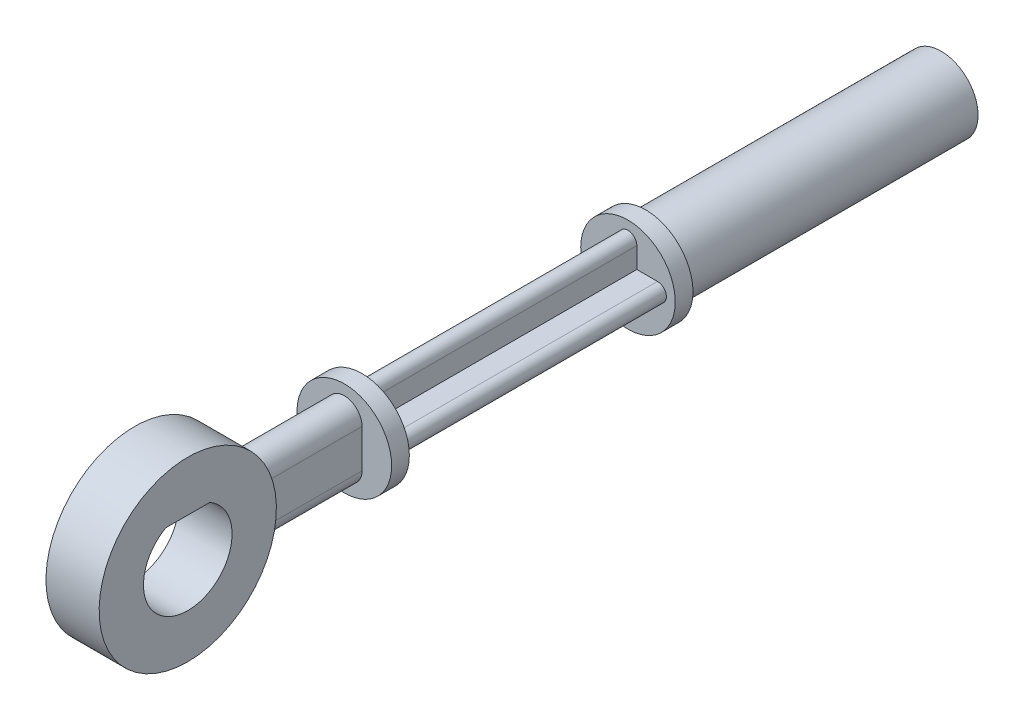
ISO-10303-21;
HEADER;
FILE_DESCRIPTION(('STEP AP214'),'2;1');
FILE_NAME('part.step','',(''),(''),'','','');
FILE_SCHEMA(('AUTOMOTIVE_DESIGN { 1 0 10303 214 1 1 1 1 }'));
ENDSEC;
DATA;
#1=APPLICATION_CONTEXT('core data for automotive mechanical design processes');
#2=APPLICATION_PROTOCOL_DEFINITION('international standard','automotive_design',2000,#1);
#3=PRODUCT_CONTEXT('',#1,'mechanical');
#4=PRODUCT('Part','Part','',(#3));
#5=PRODUCT_RELATED_PRODUCT_CATEGORY('part','',(#4));
#6=PRODUCT_DEFINITION_FORMATION('','',#4);
#7=PRODUCT_DEFINITION_CONTEXT('part definition',#1,'design');
#8=PRODUCT_DEFINITION('design','',#6,#7);
#9=PRODUCT_DEFINITION_SHAPE('','',#8);
#10=(LENGTH_UNIT() NAMED_UNIT(*) SI_UNIT(.MILLI.,.METRE.));
#11=(NAMED_UNIT(*) PLANE_ANGLE_UNIT() SI_UNIT($,.RADIAN.));
#12=(NAMED_UNIT(*) SI_UNIT($,.STERADIAN.) SOLID_ANGLE_UNIT());
#13=UNCERTAINTY_MEASURE_WITH_UNIT(LENGTH_MEASURE(1.E-05),#10,'distance_accuracy_value','');
#14=(GEOMETRIC_REPRESENTATION_CONTEXT(3) GLOBAL_UNCERTAINTY_ASSIGNED_CONTEXT((#13)) GLOBAL_UNIT_ASSIGNED_CONTEXT((#10,
#11,#12)) REPRESENTATION_CONTEXT('',''));
#15=CARTESIAN_POINT('',(0.,0.,0.));
#16=DIRECTION('',(0.,0.,1.));
#17=DIRECTION('',(1.,0.,0.));
#18=AXIS2_PLACEMENT_3D('',#15,#16,#17);
#19=CARTESIAN_POINT('',(0.,0.,-99.));
#20=DIRECTION('',(0.,0.,-1.));
#21=DIRECTION('',(-1.,0.,0.));
#22=AXIS2_PLACEMENT_3D('',#19,#20,#21);
#23=PLANE('',#22);
#24=CARTESIAN_POINT('',(0.,0.,-99.));
#25=DIRECTION('',(0.,0.,-1.));
#26=DIRECTION('',(-1.,0.,0.));
#27=AXIS2_PLACEMENT_3D('',#24,#25,#26);
#28=CIRCLE('',#27,16.);
#29=CARTESIAN_POINT('',(-16.,0.,-99.));
#30=VERTEX_POINT('',#29);
#31=EDGE_CURVE('E220',#30,#30,#28,.T.);
#32=ORIENTED_EDGE('',*,*,#31,.T.);
#33=EDGE_LOOP('',(#32));
#34=FACE_BOUND('',#33,.T.);
#35=CARTESIAN_POINT('',(0.,0.,-99.));
#36=DIRECTION('',(0.,0.,-1.));
#37=DIRECTION('',(-1.,0.,0.));
#38=AXIS2_PLACEMENT_3D('',#35,#36,#37);
#39=CIRCLE('',#38,12.5);
#40=CARTESIAN_POINT('',(-12.5,0.,-99.));
#41=VERTEX_POINT('',#40);
#42=EDGE_CURVE('E174',#41,#41,#39,.T.);
#43=ORIENTED_EDGE('',*,*,#42,.F.);
#44=EDGE_LOOP('',(#43));
#45=FACE_BOUND('',#44,.T.);
#46=ADVANCED_FACE('F34',(#34,#45),#23,.T.);
#47=CARTESIAN_POINT('',(0.,6.5,92.7308492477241));
#48=DIRECTION('',(0.,0.,-1.));
#49=DIRECTION('',(-1.,0.,0.));
#50=AXIS2_PLACEMENT_3D('',#47,#48,#49);
#51=CYLINDRICAL_SURFACE('',#50,6.);
#52=CARTESIAN_POINT('',(6.,6.5,35.7126307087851));
#53=CARTESIAN_POINT('',(6.00001683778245,6.67468075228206,35.7513827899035));
#54=CARTESIAN_POINT('',(5.99237280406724,6.8489880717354,35.7917237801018));
#55=CARTESIAN_POINT('',(5.96207767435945,7.19557585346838,35.8751790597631));
#56=CARTESIAN_POINT('',(5.93943067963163,7.36785685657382,35.9182925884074));
#57=CARTESIAN_POINT('',(5.87949365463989,7.70892613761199,36.0068366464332));
#58=CARTESIAN_POINT('',(5.84222793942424,7.87771972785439,36.0522632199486));
#59=CARTESIAN_POINT('',(5.75345581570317,8.21098845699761,36.1450251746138));
#60=CARTESIAN_POINT('',(5.70194864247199,8.37546336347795,36.1923606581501));
#61=CARTESIAN_POINT('',(5.58519716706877,8.69888805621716,36.2883684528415));
#62=CARTESIAN_POINT('',(5.51996442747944,8.85784236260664,36.3370396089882));
#63=CARTESIAN_POINT('',(5.37620421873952,9.1694341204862,36.4351935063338));
#64=CARTESIAN_POINT('',(5.29767188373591,9.32206923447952,36.4846765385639));
#65=CARTESIAN_POINT('',(5.12785042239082,9.6200250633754,36.5838114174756));
#66=CARTESIAN_POINT('',(5.03656053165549,9.76534533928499,36.6334632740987));
#67=CARTESIAN_POINT('',(4.84175083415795,10.0478011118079,36.7322782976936));
#68=CARTESIAN_POINT('',(4.73822677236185,10.1849337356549,36.781441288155));
#69=CARTESIAN_POINT('',(4.51716721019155,10.4529780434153,36.8796147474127));
#70=CARTESIAN_POINT('',(4.39937446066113,10.5836876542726,36.9285982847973));
#71=CARTESIAN_POINT('',(4.15234530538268,10.8346310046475,37.0244961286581));
#72=CARTESIAN_POINT('',(4.02310928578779,10.95486509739,37.0714105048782));
#73=CARTESIAN_POINT('',(3.75391275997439,11.1839492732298,37.1623551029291));
#74=CARTESIAN_POINT('',(3.61395004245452,11.2927969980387,37.2063847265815));
#75=CARTESIAN_POINT('',(3.3242357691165,11.4980955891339,37.2906854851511));
#76=CARTESIAN_POINT('',(3.17448871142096,11.5945520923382,37.3309583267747));
#77=CARTESIAN_POINT('',(2.87078464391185,11.7714837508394,37.4057774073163));
#78=CARTESIAN_POINT('',(2.71709124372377,11.8523534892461,37.4404598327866));
#79=CARTESIAN_POINT('',(2.40246071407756,12.0007653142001,37.5047608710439));
#80=CARTESIAN_POINT('',(2.24152699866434,12.0683136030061,37.5343818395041));
#81=CARTESIAN_POINT('',(1.91359644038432,12.1893481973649,37.587882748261));
#82=CARTESIAN_POINT('',(1.74660196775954,12.2428399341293,37.6117649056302));
#83=CARTESIAN_POINT('',(1.40783822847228,12.3351351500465,37.6532084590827));
#84=CARTESIAN_POINT('',(1.23606938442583,12.3739399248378,37.6707704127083));
#85=CARTESIAN_POINT('',(0.903621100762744,12.4337667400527,37.6979409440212));
#86=CARTESIAN_POINT('',(0.743201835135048,12.4559956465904,37.7080878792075));
#87=CARTESIAN_POINT('',(0.420830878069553,12.4874137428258,37.7224487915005));
#88=CARTESIAN_POINT('',(0.258879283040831,12.496603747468,37.7266631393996));
#89=CARTESIAN_POINT('',(-0.0652387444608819,12.5018337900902,37.7290601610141));
#90=CARTESIAN_POINT('',(-0.227405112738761,12.4978771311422,37.7272443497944));
#91=CARTESIAN_POINT('',(-0.550706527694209,12.4768688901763,37.7176270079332));
#92=CARTESIAN_POINT('',(-0.71184159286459,12.459817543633,37.7098255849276));
#93=CARTESIAN_POINT('',(-1.02365872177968,12.4140237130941,37.6889654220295));
#94=CARTESIAN_POINT('',(-1.17445482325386,12.3859217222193,37.6761950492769));
#95=CARTESIAN_POINT('',(-1.47302447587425,12.3183874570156,37.6456821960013));
#96=CARTESIAN_POINT('',(-1.62079702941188,12.2789515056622,37.627938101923));
#97=CARTESIAN_POINT('',(-1.91228800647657,12.1891481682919,37.5878296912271));
#98=CARTESIAN_POINT('',(-2.05600752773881,12.138783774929,37.5654666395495));
#99=CARTESIAN_POINT('',(-2.33863654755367,12.0275541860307,37.5165207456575));
#100=CARTESIAN_POINT('',(-2.47754419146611,11.9666849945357,37.489936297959));
#101=CARTESIAN_POINT('',(-2.7543570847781,11.8327240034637,37.4320450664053));
#102=CARTESIAN_POINT('',(-2.89206887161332,11.7592879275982,37.4006087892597));
#103=CARTESIAN_POINT('',(-3.16076574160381,11.6023332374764,37.3342606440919));
#104=CARTESIAN_POINT('',(-3.29174833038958,11.5188109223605,37.2993475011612));
#105=CARTESIAN_POINT('',(-3.67354374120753,11.2540353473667,37.1902345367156));
#106=CARTESIAN_POINT('',(-3.91339510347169,11.0584804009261,37.111620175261));
#107=CARTESIAN_POINT('',(-4.37696518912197,10.617380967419,36.9405705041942));
#108=CARTESIAN_POINT('',(-4.59781140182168,10.3690729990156,36.8475316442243));
#109=CARTESIAN_POINT('',(-4.99540001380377,9.8399695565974,36.6582686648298));
#110=CARTESIAN_POINT('',(-5.17211297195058,9.55915257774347,36.5620424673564));
#111=CARTESIAN_POINT('',(-5.40510638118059,9.11064256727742,36.4163864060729));
#112=CARTESIAN_POINT('',(-5.47889311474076,8.95201500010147,36.3662769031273));
#113=CARTESIAN_POINT('',(-5.61243633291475,8.62864118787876,36.2671777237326));
#114=CARTESIAN_POINT('',(-5.6721977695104,8.46389712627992,36.2181876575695));
#115=CARTESIAN_POINT('',(-5.77712565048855,8.12956823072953,36.1219744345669));
#116=CARTESIAN_POINT('',(-5.82230945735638,7.95998941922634,36.0747492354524));
#117=CARTESIAN_POINT('',(-5.8977186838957,7.61701279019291,35.9825462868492));
#118=CARTESIAN_POINT('',(-5.92795163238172,7.44361694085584,35.9375674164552));
#119=CARTESIAN_POINT('',(-5.96696182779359,7.14173021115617,35.8621744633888));
#120=CARTESIAN_POINT('',(-5.97933805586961,7.01385157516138,35.8311260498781));
#121=CARTESIAN_POINT('',(-5.99585278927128,6.75738395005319,35.7706456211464));
#122=CARTESIAN_POINT('',(-6.00000340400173,6.62879628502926,35.7412112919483));
#123=CARTESIAN_POINT('',(-6.,6.5,35.7126307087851));
#124=B_SPLINE_CURVE_WITH_KNOTS('',3,(#52,#53,#54,#55,#56,#57,#58,#59,#60,#61,#62,#63,#64,#65,
#66,#67,#68,#69,#70,#71,#72,#73,#74,#75,#76,#77,#78,#79,#80,#81,#82,#83,#84,#85,#86,#87,#88,#89,
#90,#91,#92,#93,#94,#95,#96,#97,#98,#99,#100,#101,#102,#103,#104,#105,#106,#107,#108,#109,#110,
#111,#112,#113,#114,#115,#116,#117,#118,#119,#120,#121,#122,#123),.UNSPECIFIED.,.F.,.F.,(4,2,2,
2,2,2,2,2,2,2,2,2,2,2,2,2,2,2,2,2,2,2,2,2,2,2,2,2,2,2,2,2,2,2,2,4),(0.,0.536582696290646,
1.07301877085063,1.60856635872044,2.14414270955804,2.67926967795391,3.21459285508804,
3.74994812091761,4.28549013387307,4.83276333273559,5.38001807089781,5.92738593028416,
6.47450389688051,7.00510328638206,7.53545505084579,8.06560159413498,8.59570135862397,
9.08188575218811,9.56803975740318,10.0540716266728,10.540094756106,11.0013345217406,
11.4627240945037,11.923987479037,12.3854267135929,12.8625019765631,13.3397528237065,
14.2936127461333,15.3245982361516,16.3562696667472,16.9016825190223,17.4469025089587,
17.9914707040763,18.5357643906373,18.9320335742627,19.3277189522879),.UNSPECIFIED.);
#125=CARTESIAN_POINT('',(6.,6.5,35.7126307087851));
#126=VERTEX_POINT('',#125);
#127=CARTESIAN_POINT('',(-6.,6.5,35.7126307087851));
#128=VERTEX_POINT('',#127);
#129=EDGE_CURVE('E212',#126,#128,#124,.T.);
#130=ORIENTED_EDGE('',*,*,#129,.F.);
#131=DIRECTION('',(0.,0.,-1.));
#132=VECTOR('',#131,1.);
#133=CARTESIAN_POINT('',(6.,6.5,92.7308492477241));
#134=LINE('',#133,#132);
#135=CARTESIAN_POINT('',(6.,6.5,3.));
#136=VERTEX_POINT('',#135);
#137=EDGE_CURVE('E312',#126,#136,#134,.T.);
#138=ORIENTED_EDGE('',*,*,#137,.T.);
#139=CARTESIAN_POINT('',(0.,6.5,3.));
#140=DIRECTION('',(0.,0.,1.));
#141=DIRECTION('',(1.,0.,0.));
#142=AXIS2_PLACEMENT_3D('',#139,#140,#141);
#143=CIRCLE('',#142,6.);
#144=CARTESIAN_POINT('',(-6.,6.5,3.));
#145=VERTEX_POINT('',#144);
#146=EDGE_CURVE('E328',#136,#145,#143,.T.);
#147=ORIENTED_EDGE('',*,*,#146,.T.);
#148=DIRECTION('',(0.,0.,-1.));
#149=VECTOR('',#148,1.);
#150=CARTESIAN_POINT('',(-6.,6.5,92.7308492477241));
#151=LINE('',#150,#149);
#152=EDGE_CURVE('E324',#128,#145,#151,.T.);
#153=ORIENTED_EDGE('',*,*,#152,.F.);
#154=EDGE_LOOP('',(#130,#138,#147,#153));
#155=FACE_BOUND('',#154,.T.);
#156=ADVANCED_FACE('F222',(#155),#51,.T.);
#157=CARTESIAN_POINT('',(0.,-6.5,92.7308492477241));
#158=DIRECTION('',(0.,0.,-1.));
#159=DIRECTION('',(-1.,0.,0.));
#160=AXIS2_PLACEMENT_3D('',#157,#158,#159);
#161=CYLINDRICAL_SURFACE('',#160,6.);
#162=CARTESIAN_POINT('',(-6.,-6.5,35.7126307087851));
#163=CARTESIAN_POINT('',(-6.00001683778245,-6.67468075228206,35.7513827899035));
#164=CARTESIAN_POINT('',(-5.99237280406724,-6.8489880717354,35.7917237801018));
#165=CARTESIAN_POINT('',(-5.96207767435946,-7.19557585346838,35.8751790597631));
#166=CARTESIAN_POINT('',(-5.93943067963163,-7.36785685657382,35.9182925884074));
#167=CARTESIAN_POINT('',(-5.8794936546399,-7.70892613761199,36.0068366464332));
#168=CARTESIAN_POINT('',(-5.84222793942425,-7.87771972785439,36.0522632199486));
#169=CARTESIAN_POINT('',(-5.75345581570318,-8.21098845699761,36.1450251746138));
#170=CARTESIAN_POINT('',(-5.70194864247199,-8.37546336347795,36.1923606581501));
#171=CARTESIAN_POINT('',(-5.58519716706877,-8.69888805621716,36.2883684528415));
#172=CARTESIAN_POINT('',(-5.51996442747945,-8.85784236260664,36.3370396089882));
#173=CARTESIAN_POINT('',(-5.37620421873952,-9.1694341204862,36.4351935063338));
#174=CARTESIAN_POINT('',(-5.29767188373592,-9.32206923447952,36.4846765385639));
#175=CARTESIAN_POINT('',(-5.12785042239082,-9.6200250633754,36.5838114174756));
#176=CARTESIAN_POINT('',(-5.0365605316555,-9.76534533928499,36.6334632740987));
#177=CARTESIAN_POINT('',(-4.84175083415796,-10.0478011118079,36.7322782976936));
#178=CARTESIAN_POINT('',(-4.73822677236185,-10.1849337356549,36.781441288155));
#179=CARTESIAN_POINT('',(-4.51716721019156,-10.4529780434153,36.8796147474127));
#180=CARTESIAN_POINT('',(-4.39937446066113,-10.5836876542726,36.9285982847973));
#181=CARTESIAN_POINT('',(-4.15234530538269,-10.8346310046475,37.0244961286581));
#182=CARTESIAN_POINT('',(-4.0231092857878,-10.95486509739,37.0714105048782));
#183=CARTESIAN_POINT('',(-3.75391275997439,-11.1839492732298,37.1623551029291));
#184=CARTESIAN_POINT('',(-3.61395004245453,-11.2927969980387,37.2063847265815));
#185=CARTESIAN_POINT('',(-3.32423576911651,-11.4980955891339,37.2906854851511));
#186=CARTESIAN_POINT('',(-3.17448871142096,-11.5945520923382,37.3309583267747));
#187=CARTESIAN_POINT('',(-2.87078464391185,-11.7714837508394,37.4057774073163));
#188=CARTESIAN_POINT('',(-2.71709124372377,-11.8523534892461,37.4404598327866));
#189=CARTESIAN_POINT('',(-2.40246071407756,-12.0007653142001,37.5047608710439));
#190=CARTESIAN_POINT('',(-2.24152699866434,-12.0683136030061,37.5343818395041));
#191=CARTESIAN_POINT('',(-1.91359644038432,-12.1893481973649,37.587882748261));
#192=CARTESIAN_POINT('',(-1.74660196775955,-12.2428399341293,37.6117649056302));
#193=CARTESIAN_POINT('',(-1.40783822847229,-12.3351351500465,37.6532084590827));
#194=CARTESIAN_POINT('',(-1.23606938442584,-12.3739399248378,37.6707704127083));
#195=CARTESIAN_POINT('',(-0.903621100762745,-12.4337667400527,37.6979409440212));
#196=CARTESIAN_POINT('',(-0.743201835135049,-12.4559956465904,37.7080878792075));
#197=CARTESIAN_POINT('',(-0.420830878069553,-12.4874137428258,37.7224487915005));
#198=CARTESIAN_POINT('',(-0.258879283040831,-12.496603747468,37.7266631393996));
#199=CARTESIAN_POINT('',(0.0652387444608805,-12.5018337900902,37.7290601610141));
#200=CARTESIAN_POINT('',(0.227405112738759,-12.4978771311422,37.7272443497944));
#201=CARTESIAN_POINT('',(0.550706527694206,-12.4768688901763,37.7176270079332));
#202=CARTESIAN_POINT('',(0.711841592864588,-12.459817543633,37.7098255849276));
#203=CARTESIAN_POINT('',(1.02365872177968,-12.4140237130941,37.6889654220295));
#204=CARTESIAN_POINT('',(1.17445482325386,-12.3859217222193,37.6761950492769));
#205=CARTESIAN_POINT('',(1.47302447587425,-12.3183874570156,37.6456821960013));
#206=CARTESIAN_POINT('',(1.62079702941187,-12.2789515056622,37.627938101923));
#207=CARTESIAN_POINT('',(1.91228800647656,-12.1891481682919,37.5878296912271));
#208=CARTESIAN_POINT('',(2.05600752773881,-12.138783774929,37.5654666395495));
#209=CARTESIAN_POINT('',(2.33863654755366,-12.0275541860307,37.5165207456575));
#210=CARTESIAN_POINT('',(2.4775441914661,-11.9666849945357,37.489936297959));
#211=CARTESIAN_POINT('',(2.7543570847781,-11.8327240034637,37.4320450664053));
#212=CARTESIAN_POINT('',(2.89206887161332,-11.7592879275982,37.4006087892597));
#213=CARTESIAN_POINT('',(3.16076574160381,-11.6023332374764,37.3342606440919));
#214=CARTESIAN_POINT('',(3.29174833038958,-11.5188109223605,37.2993475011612));
#215=CARTESIAN_POINT('',(3.67354374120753,-11.2540353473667,37.1902345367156));
#216=CARTESIAN_POINT('',(3.91339510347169,-11.0584804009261,37.111620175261));
#217=CARTESIAN_POINT('',(4.37696518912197,-10.617380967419,36.9405705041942));
#218=CARTESIAN_POINT('',(4.59781140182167,-10.3690729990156,36.8475316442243));
#219=CARTESIAN_POINT('',(4.99540001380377,-9.8399695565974,36.6582686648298));
#220=CARTESIAN_POINT('',(5.17211297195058,-9.55915257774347,36.5620424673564));
#221=CARTESIAN_POINT('',(5.40510638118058,-9.11064256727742,36.4163864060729));
#222=CARTESIAN_POINT('',(5.47889311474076,-8.95201500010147,36.3662769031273));
#223=CARTESIAN_POINT('',(5.61243633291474,-8.62864118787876,36.2671777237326));
#224=CARTESIAN_POINT('',(5.6721977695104,-8.46389712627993,36.2181876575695));
#225=CARTESIAN_POINT('',(5.77712565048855,-8.12956823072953,36.1219744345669));
#226=CARTESIAN_POINT('',(5.82230945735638,-7.95998941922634,36.0747492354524));
#227=CARTESIAN_POINT('',(5.89771868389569,-7.61701279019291,35.9825462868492));
#228=CARTESIAN_POINT('',(5.92795163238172,-7.44361694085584,35.9375674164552));
#229=CARTESIAN_POINT('',(5.96696182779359,-7.14173021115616,35.8621744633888));
#230=CARTESIAN_POINT('',(5.97933805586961,-7.01385157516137,35.8311260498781));
#231=CARTESIAN_POINT('',(5.99585278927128,-6.75738395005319,35.7706456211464));
#232=CARTESIAN_POINT('',(6.00000340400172,-6.62879628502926,35.7412112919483));
#233=CARTESIAN_POINT('',(6.,-6.5,35.7126307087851));
#234=B_SPLINE_CURVE_WITH_KNOTS('',3,(#162,#163,#164,#165,#166,#167,#168,#169,#170,#171,#172,
#173,#174,#175,#176,#177,#178,#179,#180,#181,#182,#183,#184,#185,#186,#187,#188,#189,#190,#191,
#192,#193,#194,#195,#196,#197,#198,#199,#200,#201,#202,#203,#204,#205,#206,#207,#208,#209,#210,
#211,#212,#213,#214,#215,#216,#217,#218,#219,#220,#221,#222,#223,#224,#225,#226,#227,#228,#229,
#230,#231,#232,#233),.UNSPECIFIED.,.F.,.F.,(4,2,2,2,2,2,2,2,2,2,2,2,2,2,2,2,2,2,2,2,2,2,2,2,2,2,
2,2,2,2,2,2,2,2,2,4),(0.,0.536582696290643,1.07301877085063,1.60856635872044,2.14414270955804,
2.67926967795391,3.21459285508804,3.74994812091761,4.28549013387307,4.83276333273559,
5.38001807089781,5.92738593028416,6.47450389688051,7.00510328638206,7.53545505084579,
8.06560159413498,8.59570135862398,9.08188575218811,9.56803975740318,10.0540716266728,
10.540094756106,11.0013345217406,11.4627240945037,11.923987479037,12.3854267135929,
12.8625019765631,13.3397528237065,14.2936127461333,15.3245982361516,16.3562696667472,
16.9016825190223,17.4469025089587,17.9914707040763,18.5357643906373,18.9320335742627,
19.3277189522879),.UNSPECIFIED.);
#235=CARTESIAN_POINT('',(-6.,-6.5,35.7126307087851));
#236=VERTEX_POINT('',#235);
#237=CARTESIAN_POINT('',(6.,-6.5,35.7126307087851));
#238=VERTEX_POINT('',#237);
#239=EDGE_CURVE('E187',#236,#238,#234,.T.);
#240=ORIENTED_EDGE('',*,*,#239,.F.);
#241=DIRECTION('',(0.,0.,-1.));
#242=VECTOR('',#241,1.);
#243=CARTESIAN_POINT('',(-6.,-6.5,92.7308492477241));
#244=LINE('',#243,#242);
#245=CARTESIAN_POINT('',(-6.,-6.5,3.));
#246=VERTEX_POINT('',#245);
#247=EDGE_CURVE('E326',#236,#246,#244,.T.);
#248=ORIENTED_EDGE('',*,*,#247,.T.);
#249=CARTESIAN_POINT('',(0.,-6.5,3.));
#250=DIRECTION('',(0.,0.,1.));
#251=DIRECTION('',(1.,0.,0.));
#252=AXIS2_PLACEMENT_3D('',#249,#250,#251);
#253=CIRCLE('',#252,6.);
#254=CARTESIAN_POINT('',(6.,-6.5,3.));
#255=VERTEX_POINT('',#254);
#256=EDGE_CURVE('E317',#246,#255,#253,.T.);
#257=ORIENTED_EDGE('',*,*,#256,.T.);
#258=DIRECTION('',(0.,0.,-1.));
#259=VECTOR('',#258,1.);
#260=CARTESIAN_POINT('',(6.,-6.5,92.7308492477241));
#261=LINE('',#260,#259);
#262=EDGE_CURVE('E310',#238,#255,#261,.T.);
#263=ORIENTED_EDGE('',*,*,#262,.F.);
#264=EDGE_LOOP('',(#240,#248,#257,#263));
#265=FACE_BOUND('',#264,.T.);
#266=ADVANCED_FACE('F197',(#265),#161,.T.);
#267=CARTESIAN_POINT('',(0.,0.,-3.));
#268=DIRECTION('',(0.,0.,1.));
#269=DIRECTION('',(1.,0.,0.));
#270=AXIS2_PLACEMENT_3D('',#267,#268,#269);
#271=PLANE('',#270);
#272=CARTESIAN_POINT('',(0.,0.,-3.));
#273=DIRECTION('',(0.,0.,1.));
#274=DIRECTION('',(1.,0.,0.));
#275=AXIS2_PLACEMENT_3D('',#272,#273,#274);
#276=CIRCLE('',#275,16.);
#277=CARTESIAN_POINT('',(16.,0.,-3.));
#278=VERTEX_POINT('',#277);
#279=EDGE_CURVE('E339',#278,#278,#276,.T.);
#280=ORIENTED_EDGE('',*,*,#279,.F.);
#281=EDGE_LOOP('',(#280));
#282=FACE_BOUND('',#281,.T.);
#283=DIRECTION('',(1.,0.,0.));
#284=VECTOR('',#283,1.);
#285=CARTESIAN_POINT('',(10.,3.,-3.));
#286=LINE('',#285,#284);
#287=CARTESIAN_POINT('',(3.,3.,-3.));
#288=VERTEX_POINT('',#287);
#289=CARTESIAN_POINT('',(10.,3.,-3.));
#290=VERTEX_POINT('',#289);
#291=EDGE_CURVE('E415',#288,#290,#286,.T.);
#292=ORIENTED_EDGE('',*,*,#291,.F.);
#293=DIRECTION('',(0.,-1.,0.));
#294=VECTOR('',#293,1.);
#295=CARTESIAN_POINT('',(3.,3.,-3.));
#296=LINE('',#295,#294);
#297=CARTESIAN_POINT('',(3.,10.,-3.));
#298=VERTEX_POINT('',#297);
#299=EDGE_CURVE('E381',#298,#288,#296,.T.);
#300=ORIENTED_EDGE('',*,*,#299,.F.);
#301=CARTESIAN_POINT('',(0.,10.,-3.));
#302=DIRECTION('',(0.,0.,-1.));
#303=DIRECTION('',(1.,0.,0.));
#304=AXIS2_PLACEMENT_3D('',#301,#302,#303);
#305=CIRCLE('',#304,3.);
#306=CARTESIAN_POINT('',(-3.,10.,-3.));
#307=VERTEX_POINT('',#306);
#308=EDGE_CURVE('E385',#307,#298,#305,.T.);
#309=ORIENTED_EDGE('',*,*,#308,.F.);
#310=DIRECTION('',(0.,1.,0.));
#311=VECTOR('',#310,1.);
#312=CARTESIAN_POINT('',(-3.,10.,-3.));
#313=LINE('',#312,#311);
#314=CARTESIAN_POINT('',(-3.,3.,-3.));
#315=VERTEX_POINT('',#314);
#316=EDGE_CURVE('E388',#315,#307,#313,.T.);
#317=ORIENTED_EDGE('',*,*,#316,.F.);
#318=DIRECTION('',(1.,0.,0.));
#319=VECTOR('',#318,1.);
#320=CARTESIAN_POINT('',(-3.,3.,-3.));
#321=LINE('',#320,#319);
#322=CARTESIAN_POINT('',(-10.,3.,-3.));
#323=VERTEX_POINT('',#322);
#324=EDGE_CURVE('E391',#323,#315,#321,.T.);
#325=ORIENTED_EDGE('',*,*,#324,.F.);
#326=CARTESIAN_POINT('',(-10.,0.,-3.));
#327=DIRECTION('',(0.,0.,-1.));
#328=DIRECTION('',(1.,0.,0.));
#329=AXIS2_PLACEMENT_3D('',#326,#327,#328);
#330=CIRCLE('',#329,3.);
#331=CARTESIAN_POINT('',(-10.,-3.,-3.));
#332=VERTEX_POINT('',#331);
#333=EDGE_CURVE('E394',#332,#323,#330,.T.);
#334=ORIENTED_EDGE('',*,*,#333,.F.);
#335=DIRECTION('',(-1.,0.,0.));
#336=VECTOR('',#335,1.);
#337=CARTESIAN_POINT('',(-10.,-3.,-3.));
#338=LINE('',#337,#336);
#339=CARTESIAN_POINT('',(-3.,-3.,-3.));
#340=VERTEX_POINT('',#339);
#341=EDGE_CURVE('E397',#340,#332,#338,.T.);
#342=ORIENTED_EDGE('',*,*,#341,.F.);
#343=DIRECTION('',(0.,1.,0.));
#344=VECTOR('',#343,1.);
#345=CARTESIAN_POINT('',(-3.,-3.,-3.));
#346=LINE('',#345,#344);
#347=CARTESIAN_POINT('',(-3.,-10.,-3.));
#348=VERTEX_POINT('',#347);
#349=EDGE_CURVE('E400',#348,#340,#346,.T.);
#350=ORIENTED_EDGE('',*,*,#349,.F.);
#351=CARTESIAN_POINT('',(0.,-10.,-3.));
#352=DIRECTION('',(0.,0.,-1.));
#353=DIRECTION('',(1.,0.,0.));
#354=AXIS2_PLACEMENT_3D('',#351,#352,#353);
#355=CIRCLE('',#354,3.);
#356=CARTESIAN_POINT('',(3.,-10.,-3.));
#357=VERTEX_POINT('',#356);
#358=EDGE_CURVE('E403',#357,#348,#355,.T.);
#359=ORIENTED_EDGE('',*,*,#358,.F.);
#360=DIRECTION('',(0.,-1.,0.));
#361=VECTOR('',#360,1.);
#362=CARTESIAN_POINT('',(3.,-10.,-3.));
#363=LINE('',#362,#361);
#364=CARTESIAN_POINT('',(3.,-3.,-3.));
#365=VERTEX_POINT('',#364);
#366=EDGE_CURVE('E406',#365,#357,#363,.T.);
#367=ORIENTED_EDGE('',*,*,#366,.F.);
#368=DIRECTION('',(-1.,0.,0.));
#369=VECTOR('',#368,1.);
#370=CARTESIAN_POINT('',(3.,-3.,-3.));
#371=LINE('',#370,#369);
#372=CARTESIAN_POINT('',(10.,-3.,-3.));
#373=VERTEX_POINT('',#372);
#374=EDGE_CURVE('E409',#373,#365,#371,.T.);
#375=ORIENTED_EDGE('',*,*,#374,.F.);
#376=CARTESIAN_POINT('',(10.,0.,-3.));
#377=DIRECTION('',(0.,0.,-1.));
#378=DIRECTION('',(1.,0.,0.));
#379=AXIS2_PLACEMENT_3D('',#376,#377,#378);
#380=CIRCLE('',#379,3.);
#381=EDGE_CURVE('E412',#290,#373,#380,.T.);
#382=ORIENTED_EDGE('',*,*,#381,.F.);
#383=EDGE_LOOP('',(#292,#300,#309,#317,#325,#334,#342,#350,#359,#367,#375,#382));
#384=FACE_BOUND('',#383,.T.);
#385=ADVANCED_FACE('F230',(#282,#384),#271,.F.);
#386=CARTESIAN_POINT('',(0.,0.,3.));
#387=DIRECTION('',(0.,0.,1.));
#388=DIRECTION('',(1.,0.,0.));
#389=AXIS2_PLACEMENT_3D('',#386,#387,#388);
#390=PLANE('',#389);
#391=CARTESIAN_POINT('',(0.,0.,3.));
#392=DIRECTION('',(0.,0.,1.));
#393=DIRECTION('',(1.,0.,0.));
#394=AXIS2_PLACEMENT_3D('',#391,#392,#393);
#395=CIRCLE('',#394,16.);
#396=CARTESIAN_POINT('',(16.,0.,3.));
#397=VERTEX_POINT('',#396);
#398=EDGE_CURVE('E42',#397,#397,#395,.T.);
#399=ORIENTED_EDGE('',*,*,#398,.T.);
#400=EDGE_LOOP('',(#399));
#401=FACE_BOUND('',#400,.T.);
#402=DIRECTION('',(0.,-1.,0.));
#403=VECTOR('',#402,1.);
#404=CARTESIAN_POINT('',(-6.,6.5,3.));
#405=LINE('',#404,#403);
#406=EDGE_CURVE('E330',#145,#246,#405,.T.);
#407=ORIENTED_EDGE('',*,*,#406,.F.);
#408=ORIENTED_EDGE('',*,*,#146,.F.);
#409=DIRECTION('',(0.,1.,0.));
#410=VECTOR('',#409,1.);
#411=CARTESIAN_POINT('',(6.,6.5,3.));
#412=LINE('',#411,#410);
#413=EDGE_CURVE('E319',#255,#136,#412,.T.);
#414=ORIENTED_EDGE('',*,*,#413,.F.);
#415=ORIENTED_EDGE('',*,*,#256,.F.);
#416=EDGE_LOOP('',(#407,#408,#414,#415));
#417=FACE_BOUND('',#416,.T.);
#418=ADVANCED_FACE('F228',(#401,#417),#390,.T.);
#419=CARTESIAN_POINT('',(0.,0.,3.));
#420=DIRECTION('',(0.,0.,-1.));
#421=DIRECTION('',(-1.,0.,0.));
#422=AXIS2_PLACEMENT_3D('',#419,#420,#421);
#423=CYLINDRICAL_SURFACE('',#422,16.);
#424=ORIENTED_EDGE('',*,*,#398,.F.);
#425=EDGE_LOOP('',(#424));
#426=FACE_BOUND('',#425,.T.);
#427=ORIENTED_EDGE('',*,*,#279,.T.);
#428=EDGE_LOOP('',(#427));
#429=FACE_BOUND('',#428,.T.);
#430=ADVANCED_FACE('F36',(#426,#429),#423,.T.);
#431=CARTESIAN_POINT('',(-6.,6.5,92.7308492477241));
#432=DIRECTION('',(1.,0.,0.));
#433=DIRECTION('',(0.,0.,-1.));
#434=AXIS2_PLACEMENT_3D('',#431,#432,#433);
#435=PLANE('',#434);
#436=CARTESIAN_POINT('',(-6.,0.,65.));
#437=DIRECTION('',(1.,0.,0.));
#438=DIRECTION('',(0.,0.,-1.));
#439=AXIS2_PLACEMENT_3D('',#436,#437,#438);
#440=CIRCLE('',#439,30.);
#441=EDGE_CURVE('E195',#128,#236,#440,.F.);
#442=ORIENTED_EDGE('',*,*,#441,.F.);
#443=ORIENTED_EDGE('',*,*,#152,.T.);
#444=ORIENTED_EDGE('',*,*,#406,.T.);
#445=ORIENTED_EDGE('',*,*,#247,.F.);
#446=EDGE_LOOP('',(#442,#443,#444,#445));
#447=FACE_BOUND('',#446,.T.);
#448=ADVANCED_FACE('F227',(#447),#435,.F.);
#449=CARTESIAN_POINT('',(6.,6.5,92.7308492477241));
#450=DIRECTION('',(-1.,0.,0.));
#451=DIRECTION('',(0.,0.,1.));
#452=AXIS2_PLACEMENT_3D('',#449,#450,#451);
#453=PLANE('',#452);
#454=CARTESIAN_POINT('',(6.,0.,65.));
#455=DIRECTION('',(-1.,0.,0.));
#456=DIRECTION('',(0.,0.,1.));
#457=AXIS2_PLACEMENT_3D('',#454,#455,#456);
#458=CIRCLE('',#457,30.);
#459=EDGE_CURVE('E11',#238,#126,#458,.F.);
#460=ORIENTED_EDGE('',*,*,#459,.F.);
#461=ORIENTED_EDGE('',*,*,#262,.T.);
#462=ORIENTED_EDGE('',*,*,#413,.T.);
#463=ORIENTED_EDGE('',*,*,#137,.F.);
#464=EDGE_LOOP('',(#460,#461,#462,#463));
#465=FACE_BOUND('',#464,.T.);
#466=ADVANCED_FACE('F300',(#465),#453,.F.);
#467=CARTESIAN_POINT('',(10.,3.,-93.));
#468=DIRECTION('',(0.,-1.,0.));
#469=DIRECTION('',(0.,0.,-1.));
#470=AXIS2_PLACEMENT_3D('',#467,#468,#469);
#471=PLANE('',#470);
#472=ORIENTED_EDGE('',*,*,#291,.T.);
#473=DIRECTION('',(0.,0.,1.));
#474=VECTOR('',#473,1.);
#475=CARTESIAN_POINT('',(10.,3.,-93.));
#476=LINE('',#475,#474);
#477=CARTESIAN_POINT('',(10.,3.,-93.));
#478=VERTEX_POINT('',#477);
#479=EDGE_CURVE('E337',#478,#290,#476,.T.);
#480=ORIENTED_EDGE('',*,*,#479,.F.);
#481=DIRECTION('',(1.,0.,0.));
#482=VECTOR('',#481,1.);
#483=CARTESIAN_POINT('',(10.,3.,-93.));
#484=LINE('',#483,#482);
#485=CARTESIAN_POINT('',(3.,3.,-93.));
#486=VERTEX_POINT('',#485);
#487=EDGE_CURVE('E384',#486,#478,#484,.T.);
#488=ORIENTED_EDGE('',*,*,#487,.F.);
#489=DIRECTION('',(0.,0.,1.));
#490=VECTOR('',#489,1.);
#491=CARTESIAN_POINT('',(3.,3.,-93.));
#492=LINE('',#491,#490);
#493=EDGE_CURVE('E377',#486,#288,#492,.T.);
#494=ORIENTED_EDGE('',*,*,#493,.T.);
#495=EDGE_LOOP('',(#472,#480,#488,#494));
#496=FACE_BOUND('',#495,.T.);
#497=ADVANCED_FACE('F297',(#496),#471,.F.);
#498=CARTESIAN_POINT('',(10.,0.,-93.));
#499=DIRECTION('',(0.,0.,1.));
#500=DIRECTION('',(1.,0.,0.));
#501=AXIS2_PLACEMENT_3D('',#498,#499,#500);
#502=CYLINDRICAL_SURFACE('',#501,3.);
#503=ORIENTED_EDGE('',*,*,#381,.T.);
#504=DIRECTION('',(0.,0.,1.));
#505=VECTOR('',#504,1.);
#506=CARTESIAN_POINT('',(10.,-3.,-93.));
#507=LINE('',#506,#505);
#508=CARTESIAN_POINT('',(10.,-3.,-93.));
#509=VERTEX_POINT('',#508);
#510=EDGE_CURVE('E347',#509,#373,#507,.T.);
#511=ORIENTED_EDGE('',*,*,#510,.F.);
#512=CARTESIAN_POINT('',(10.,0.,-93.));
#513=DIRECTION('',(0.,0.,-1.));
#514=DIRECTION('',(1.,0.,0.));
#515=AXIS2_PLACEMENT_3D('',#512,#513,#514);
#516=CIRCLE('',#515,3.);
#517=EDGE_CURVE('E447',#478,#509,#516,.T.);
#518=ORIENTED_EDGE('',*,*,#517,.F.);
#519=ORIENTED_EDGE('',*,*,#479,.T.);
#520=EDGE_LOOP('',(#503,#511,#518,#519));
#521=FACE_BOUND('',#520,.T.);
#522=ADVANCED_FACE('F293',(#521),#502,.T.);
#523=CARTESIAN_POINT('',(3.,-3.,-93.));
#524=DIRECTION('',(0.,1.,0.));
#525=DIRECTION('',(0.,0.,1.));
#526=AXIS2_PLACEMENT_3D('',#523,#524,#525);
#527=PLANE('',#526);
#528=ORIENTED_EDGE('',*,*,#374,.T.);
#529=DIRECTION('',(0.,0.,1.));
#530=VECTOR('',#529,1.);
#531=CARTESIAN_POINT('',(3.,-3.,-93.));
#532=LINE('',#531,#530);
#533=CARTESIAN_POINT('',(3.,-3.,-93.));
#534=VERTEX_POINT('',#533);
#535=EDGE_CURVE('E350',#534,#365,#532,.T.);
#536=ORIENTED_EDGE('',*,*,#535,.F.);
#537=DIRECTION('',(-1.,0.,0.));
#538=VECTOR('',#537,1.);
#539=CARTESIAN_POINT('',(3.,-3.,-93.));
#540=LINE('',#539,#538);
#541=EDGE_CURVE('E444',#509,#534,#540,.T.);
#542=ORIENTED_EDGE('',*,*,#541,.F.);
#543=ORIENTED_EDGE('',*,*,#510,.T.);
#544=EDGE_LOOP('',(#528,#536,#542,#543));
#545=FACE_BOUND('',#544,.T.);
#546=ADVANCED_FACE('F289',(#545),#527,.F.);
#547=CARTESIAN_POINT('',(3.,-10.,-93.));
#548=DIRECTION('',(-1.,0.,0.));
#549=DIRECTION('',(0.,0.,1.));
#550=AXIS2_PLACEMENT_3D('',#547,#548,#549);
#551=PLANE('',#550);
#552=ORIENTED_EDGE('',*,*,#366,.T.);
#553=DIRECTION('',(0.,0.,1.));
#554=VECTOR('',#553,1.);
#555=CARTESIAN_POINT('',(3.,-10.,-93.));
#556=LINE('',#555,#554);
#557=CARTESIAN_POINT('',(3.,-10.,-93.));
#558=VERTEX_POINT('',#557);
#559=EDGE_CURVE('E353',#558,#357,#556,.T.);
#560=ORIENTED_EDGE('',*,*,#559,.F.);
#561=DIRECTION('',(0.,-1.,0.));
#562=VECTOR('',#561,1.);
#563=CARTESIAN_POINT('',(3.,-10.,-93.));
#564=LINE('',#563,#562);
#565=EDGE_CURVE('E441',#534,#558,#564,.T.);
#566=ORIENTED_EDGE('',*,*,#565,.F.);
#567=ORIENTED_EDGE('',*,*,#535,.T.);
#568=EDGE_LOOP('',(#552,#560,#566,#567));
#569=FACE_BOUND('',#568,.T.);
#570=ADVANCED_FACE('F285',(#569),#551,.F.);
#571=CARTESIAN_POINT('',(0.,-10.,-93.));
#572=DIRECTION('',(0.,0.,1.));
#573=DIRECTION('',(1.,0.,0.));
#574=AXIS2_PLACEMENT_3D('',#571,#572,#573);
#575=CYLINDRICAL_SURFACE('',#574,3.);
#576=ORIENTED_EDGE('',*,*,#358,.T.);
#577=DIRECTION('',(0.,0.,1.));
#578=VECTOR('',#577,1.);
#579=CARTESIAN_POINT('',(-3.,-10.,-93.));
#580=LINE('',#579,#578);
#581=CARTESIAN_POINT('',(-3.,-10.,-93.));
#582=VERTEX_POINT('',#581);
#583=EDGE_CURVE('E356',#582,#348,#580,.T.);
#584=ORIENTED_EDGE('',*,*,#583,.F.);
#585=CARTESIAN_POINT('',(0.,-10.,-93.));
#586=DIRECTION('',(0.,0.,-1.));
#587=DIRECTION('',(1.,0.,0.));
#588=AXIS2_PLACEMENT_3D('',#585,#586,#587);
#589=CIRCLE('',#588,3.);
#590=EDGE_CURVE('E438',#558,#582,#589,.T.);
#591=ORIENTED_EDGE('',*,*,#590,.F.);
#592=ORIENTED_EDGE('',*,*,#559,.T.);
#593=EDGE_LOOP('',(#576,#584,#591,#592));
#594=FACE_BOUND('',#593,.T.);
#595=ADVANCED_FACE('F281',(#594),#575,.T.);
#596=CARTESIAN_POINT('',(-3.,-3.,-93.));
#597=DIRECTION('',(1.,0.,0.));
#598=DIRECTION('',(0.,1.,0.));
#599=AXIS2_PLACEMENT_3D('',#596,#597,#598);
#600=PLANE('',#599);
#601=ORIENTED_EDGE('',*,*,#349,.T.);
#602=DIRECTION('',(0.,0.,1.));
#603=VECTOR('',#602,1.);
#604=CARTESIAN_POINT('',(-3.,-3.,-93.));
#605=LINE('',#604,#603);
#606=CARTESIAN_POINT('',(-3.,-3.,-93.));
#607=VERTEX_POINT('',#606);
#608=EDGE_CURVE('E359',#607,#340,#605,.T.);
#609=ORIENTED_EDGE('',*,*,#608,.F.);
#610=DIRECTION('',(0.,1.,0.));
#611=VECTOR('',#610,1.);
#612=CARTESIAN_POINT('',(-3.,-3.,-93.));
#613=LINE('',#612,#611);
#614=EDGE_CURVE('E435',#582,#607,#613,.T.);
#615=ORIENTED_EDGE('',*,*,#614,.F.);
#616=ORIENTED_EDGE('',*,*,#583,.T.);
#617=EDGE_LOOP('',(#601,#609,#615,#616));
#618=FACE_BOUND('',#617,.T.);
#619=ADVANCED_FACE('F277',(#618),#600,.F.);
#620=CARTESIAN_POINT('',(-10.,-3.,-93.));
#621=DIRECTION('',(0.,1.,0.));
#622=DIRECTION('',(0.,0.,1.));
#623=AXIS2_PLACEMENT_3D('',#620,#621,#622);
#624=PLANE('',#623);
#625=ORIENTED_EDGE('',*,*,#341,.T.);
#626=DIRECTION('',(0.,0.,1.));
#627=VECTOR('',#626,1.);
#628=CARTESIAN_POINT('',(-10.,-3.,-93.));
#629=LINE('',#628,#627);
#630=CARTESIAN_POINT('',(-10.,-3.,-93.));
#631=VERTEX_POINT('',#630);
#632=EDGE_CURVE('E362',#631,#332,#629,.T.);
#633=ORIENTED_EDGE('',*,*,#632,.F.);
#634=DIRECTION('',(-1.,0.,0.));
#635=VECTOR('',#634,1.);
#636=CARTESIAN_POINT('',(-10.,-3.,-93.));
#637=LINE('',#636,#635);
#638=EDGE_CURVE('E432',#607,#631,#637,.T.);
#639=ORIENTED_EDGE('',*,*,#638,.F.);
#640=ORIENTED_EDGE('',*,*,#608,.T.);
#641=EDGE_LOOP('',(#625,#633,#639,#640));
#642=FACE_BOUND('',#641,.T.);
#643=ADVANCED_FACE('F273',(#642),#624,.F.);
#644=CARTESIAN_POINT('',(-10.,0.,-93.));
#645=DIRECTION('',(0.,0.,1.));
#646=DIRECTION('',(1.,0.,0.));
#647=AXIS2_PLACEMENT_3D('',#644,#645,#646);
#648=CYLINDRICAL_SURFACE('',#647,3.);
#649=ORIENTED_EDGE('',*,*,#333,.T.);
#650=DIRECTION('',(0.,0.,1.));
#651=VECTOR('',#650,1.);
#652=CARTESIAN_POINT('',(-10.,3.,-93.));
#653=LINE('',#652,#651);
#654=CARTESIAN_POINT('',(-10.,3.,-93.));
#655=VERTEX_POINT('',#654);
#656=EDGE_CURVE('E365',#655,#323,#653,.T.);
#657=ORIENTED_EDGE('',*,*,#656,.F.);
#658=CARTESIAN_POINT('',(-10.,0.,-93.));
#659=DIRECTION('',(0.,0.,-1.));
#660=DIRECTION('',(1.,0.,0.));
#661=AXIS2_PLACEMENT_3D('',#658,#659,#660);
#662=CIRCLE('',#661,3.);
#663=EDGE_CURVE('E429',#631,#655,#662,.T.);
#664=ORIENTED_EDGE('',*,*,#663,.F.);
#665=ORIENTED_EDGE('',*,*,#632,.T.);
#666=EDGE_LOOP('',(#649,#657,#664,#665));
#667=FACE_BOUND('',#666,.T.);
#668=ADVANCED_FACE('F269',(#667),#648,.T.);
#669=CARTESIAN_POINT('',(-3.,3.,-93.));
#670=DIRECTION('',(0.,-1.,0.));
#671=DIRECTION('',(0.,0.,-1.));
#672=AXIS2_PLACEMENT_3D('',#669,#670,#671);
#673=PLANE('',#672);
#674=ORIENTED_EDGE('',*,*,#324,.T.);
#675=DIRECTION('',(0.,0.,1.));
#676=VECTOR('',#675,1.);
#677=CARTESIAN_POINT('',(-3.,3.,-93.));
#678=LINE('',#677,#676);
#679=CARTESIAN_POINT('',(-3.,3.,-93.));
#680=VERTEX_POINT('',#679);
#681=EDGE_CURVE('E368',#680,#315,#678,.T.);
#682=ORIENTED_EDGE('',*,*,#681,.F.);
#683=DIRECTION('',(1.,0.,0.));
#684=VECTOR('',#683,1.);
#685=CARTESIAN_POINT('',(-3.,3.,-93.));
#686=LINE('',#685,#684);
#687=EDGE_CURVE('E426',#655,#680,#686,.T.);
#688=ORIENTED_EDGE('',*,*,#687,.F.);
#689=ORIENTED_EDGE('',*,*,#656,.T.);
#690=EDGE_LOOP('',(#674,#682,#688,#689));
#691=FACE_BOUND('',#690,.T.);
#692=ADVANCED_FACE('F265',(#691),#673,.F.);
#693=CARTESIAN_POINT('',(-3.,10.,-93.));
#694=DIRECTION('',(1.,0.,0.));
#695=DIRECTION('',(0.,0.,-1.));
#696=AXIS2_PLACEMENT_3D('',#693,#694,#695);
#697=PLANE('',#696);
#698=ORIENTED_EDGE('',*,*,#316,.T.);
#699=DIRECTION('',(0.,0.,1.));
#700=VECTOR('',#699,1.);
#701=CARTESIAN_POINT('',(-3.,10.,-93.));
#702=LINE('',#701,#700);
#703=CARTESIAN_POINT('',(-3.,10.,-93.));
#704=VERTEX_POINT('',#703);
#705=EDGE_CURVE('E371',#704,#307,#702,.T.);
#706=ORIENTED_EDGE('',*,*,#705,.F.);
#707=DIRECTION('',(0.,1.,0.));
#708=VECTOR('',#707,1.);
#709=CARTESIAN_POINT('',(-3.,10.,-93.));
#710=LINE('',#709,#708);
#711=EDGE_CURVE('E423',#680,#704,#710,.T.);
#712=ORIENTED_EDGE('',*,*,#711,.F.);
#713=ORIENTED_EDGE('',*,*,#681,.T.);
#714=EDGE_LOOP('',(#698,#706,#712,#713));
#715=FACE_BOUND('',#714,.T.);
#716=ADVANCED_FACE('F261',(#715),#697,.F.);
#717=CARTESIAN_POINT('',(0.,10.,-93.));
#718=DIRECTION('',(0.,0.,1.));
#719=DIRECTION('',(1.,0.,0.));
#720=AXIS2_PLACEMENT_3D('',#717,#718,#719);
#721=CYLINDRICAL_SURFACE('',#720,3.);
#722=ORIENTED_EDGE('',*,*,#308,.T.);
#723=DIRECTION('',(0.,0.,1.));
#724=VECTOR('',#723,1.);
#725=CARTESIAN_POINT('',(3.,10.,-93.));
#726=LINE('',#725,#724);
#727=CARTESIAN_POINT('',(3.,10.,-93.));
#728=VERTEX_POINT('',#727);
#729=EDGE_CURVE('E374',#728,#298,#726,.T.);
#730=ORIENTED_EDGE('',*,*,#729,.F.);
#731=CARTESIAN_POINT('',(0.,10.,-93.));
#732=DIRECTION('',(0.,0.,-1.));
#733=DIRECTION('',(1.,0.,0.));
#734=AXIS2_PLACEMENT_3D('',#731,#732,#733);
#735=CIRCLE('',#734,3.);
#736=EDGE_CURVE('E420',#704,#728,#735,.T.);
#737=ORIENTED_EDGE('',*,*,#736,.F.);
#738=ORIENTED_EDGE('',*,*,#705,.T.);
#739=EDGE_LOOP('',(#722,#730,#737,#738));
#740=FACE_BOUND('',#739,.T.);
#741=ADVANCED_FACE('F257',(#740),#721,.T.);
#742=CARTESIAN_POINT('',(3.,3.,-93.));
#743=DIRECTION('',(-1.,0.,0.));
#744=DIRECTION('',(0.,-1.,0.));
#745=AXIS2_PLACEMENT_3D('',#742,#743,#744);
#746=PLANE('',#745);
#747=ORIENTED_EDGE('',*,*,#299,.T.);
#748=ORIENTED_EDGE('',*,*,#493,.F.);
#749=DIRECTION('',(0.,-1.,0.));
#750=VECTOR('',#749,1.);
#751=CARTESIAN_POINT('',(3.,3.,-93.));
#752=LINE('',#751,#750);
#753=EDGE_CURVE('E380',#728,#486,#752,.T.);
#754=ORIENTED_EDGE('',*,*,#753,.F.);
#755=ORIENTED_EDGE('',*,*,#729,.T.);
#756=EDGE_LOOP('',(#747,#748,#754,#755));
#757=FACE_BOUND('',#756,.T.);
#758=ADVANCED_FACE('F250',(#757),#746,.F.);
#759=CARTESIAN_POINT('',(0.,0.,-93.));
#760=DIRECTION('',(0.,0.,-1.));
#761=DIRECTION('',(-1.,0.,0.));
#762=AXIS2_PLACEMENT_3D('',#759,#760,#761);
#763=PLANE('',#762);
#764=CARTESIAN_POINT('',(0.,0.,-93.));
#765=DIRECTION('',(0.,0.,-1.));
#766=DIRECTION('',(-1.,0.,0.));
#767=AXIS2_PLACEMENT_3D('',#764,#765,#766);
#768=CIRCLE('',#767,16.);
#769=CARTESIAN_POINT('',(-16.,0.,-93.));
#770=VERTEX_POINT('',#769);
#771=EDGE_CURVE('E219',#770,#770,#768,.T.);
#772=ORIENTED_EDGE('',*,*,#771,.F.);
#773=EDGE_LOOP('',(#772));
#774=FACE_BOUND('',#773,.T.);
#775=ORIENTED_EDGE('',*,*,#753,.T.);
#776=ORIENTED_EDGE('',*,*,#487,.T.);
#777=ORIENTED_EDGE('',*,*,#517,.T.);
#778=ORIENTED_EDGE('',*,*,#541,.T.);
#779=ORIENTED_EDGE('',*,*,#565,.T.);
#780=ORIENTED_EDGE('',*,*,#590,.T.);
#781=ORIENTED_EDGE('',*,*,#614,.T.);
#782=ORIENTED_EDGE('',*,*,#638,.T.);
#783=ORIENTED_EDGE('',*,*,#663,.T.);
#784=ORIENTED_EDGE('',*,*,#687,.T.);
#785=ORIENTED_EDGE('',*,*,#711,.T.);
#786=ORIENTED_EDGE('',*,*,#736,.T.);
#787=EDGE_LOOP('',(#775,#776,#777,#778,#779,#780,#781,#782,#783,#784,#785,#786));
#788=FACE_BOUND('',#787,.T.);
#789=ADVANCED_FACE('F247',(#774,#788),#763,.F.);
#790=CARTESIAN_POINT('',(0.,0.,-99.));
#791=DIRECTION('',(0.,0.,1.));
#792=DIRECTION('',(1.,0.,0.));
#793=AXIS2_PLACEMENT_3D('',#790,#791,#792);
#794=CYLINDRICAL_SURFACE('',#793,16.);
#795=ORIENTED_EDGE('',*,*,#31,.F.);
#796=EDGE_LOOP('',(#795));
#797=FACE_BOUND('',#796,.T.);
#798=ORIENTED_EDGE('',*,*,#771,.T.);
#799=EDGE_LOOP('',(#798));
#800=FACE_BOUND('',#799,.T.);
#801=ADVANCED_FACE('F207',(#797,#800),#794,.T.);
#802=CARTESIAN_POINT('',(9.,0.,65.));
#803=DIRECTION('',(-1.,0.,0.));
#804=DIRECTION('',(0.,-1.,0.));
#805=AXIS2_PLACEMENT_3D('',#802,#803,#804);
#806=CYLINDRICAL_SURFACE('',#805,30.);
#807=CARTESIAN_POINT('',(-9.,0.,65.));
#808=DIRECTION('',(-1.,0.,0.));
#809=DIRECTION('',(0.,-1.,0.));
#810=AXIS2_PLACEMENT_3D('',#807,#808,#809);
#811=CIRCLE('',#810,30.);
#812=CARTESIAN_POINT('',(-9.,-30.,65.));
#813=VERTEX_POINT('',#812);
#814=EDGE_CURVE('E184',#813,#813,#811,.T.);
#815=ORIENTED_EDGE('',*,*,#814,.F.);
#816=EDGE_LOOP('',(#815));
#817=FACE_BOUND('',#816,.T.);
#818=CARTESIAN_POINT('',(9.,0.,65.));
#819=DIRECTION('',(-1.,0.,0.));
#820=DIRECTION('',(0.,-1.,0.));
#821=AXIS2_PLACEMENT_3D('',#818,#819,#820);
#822=CIRCLE('',#821,30.);
#823=CARTESIAN_POINT('',(9.,-30.,65.));
#824=VERTEX_POINT('',#823);
#825=EDGE_CURVE('E181',#824,#824,#822,.T.);
#826=ORIENTED_EDGE('',*,*,#825,.T.);
#827=EDGE_LOOP('',(#826));
#828=FACE_BOUND('',#827,.T.);
#829=ORIENTED_EDGE('',*,*,#459,.T.);
#830=ORIENTED_EDGE('',*,*,#129,.T.);
#831=ORIENTED_EDGE('',*,*,#441,.T.);
#832=ORIENTED_EDGE('',*,*,#239,.T.);
#833=EDGE_LOOP('',(#829,#830,#831,#832));
#834=FACE_BOUND('',#833,.T.);
#835=ADVANCED_FACE('F201',(#817,#828,#834),#806,.T.);
#836=CARTESIAN_POINT('',(-9.,0.,65.));
#837=DIRECTION('',(1.,0.,0.));
#838=DIRECTION('',(0.,1.,0.));
#839=AXIS2_PLACEMENT_3D('',#836,#837,#838);
#840=PLANE('',#839);
#841=DIRECTION('',(0.,0.,1.));
#842=VECTOR('',#841,1.);
#843=CARTESIAN_POINT('',(-9.,13.,65.));
#844=LINE('',#843,#842);
#845=CARTESIAN_POINT('',(-9.,13.,57.5166852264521));
#846=VERTEX_POINT('',#845);
#847=CARTESIAN_POINT('',(-9.,13.,72.4833147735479));
#848=VERTEX_POINT('',#847);
#849=EDGE_CURVE('E161',#846,#848,#844,.T.);
#850=ORIENTED_EDGE('',*,*,#849,.T.);
#851=CARTESIAN_POINT('',(-9.,0.,65.));
#852=DIRECTION('',(1.,0.,0.));
#853=DIRECTION('',(0.,1.,0.));
#854=AXIS2_PLACEMENT_3D('',#851,#852,#853);
#855=CIRCLE('',#854,15.);
#856=EDGE_CURVE('E159',#848,#846,#855,.T.);
#857=ORIENTED_EDGE('',*,*,#856,.T.);
#858=EDGE_LOOP('',(#850,#857));
#859=FACE_BOUND('',#858,.T.);
#860=ORIENTED_EDGE('',*,*,#814,.T.);
#861=EDGE_LOOP('',(#860));
#862=FACE_BOUND('',#861,.T.);
#863=ADVANCED_FACE('F206',(#859,#862),#840,.F.);
#864=CARTESIAN_POINT('',(9.,30.,65.));
#865=DIRECTION('',(-1.,0.,0.));
#866=DIRECTION('',(0.,-1.,0.));
#867=AXIS2_PLACEMENT_3D('',#864,#865,#866);
#868=PLANE('',#867);
#869=DIRECTION('',(0.,0.,1.));
#870=VECTOR('',#869,1.);
#871=CARTESIAN_POINT('',(9.,13.,72.4833147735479));
#872=LINE('',#871,#870);
#873=CARTESIAN_POINT('',(9.,13.,57.5166852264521));
#874=VERTEX_POINT('',#873);
#875=CARTESIAN_POINT('',(9.,13.,72.4833147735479));
#876=VERTEX_POINT('',#875);
#877=EDGE_CURVE('E165',#874,#876,#872,.T.);
#878=ORIENTED_EDGE('',*,*,#877,.F.);
#879=CARTESIAN_POINT('',(9.,0.,65.));
#880=DIRECTION('',(1.,0.,0.));
#881=DIRECTION('',(0.,1.,0.));
#882=AXIS2_PLACEMENT_3D('',#879,#880,#881);
#883=CIRCLE('',#882,15.);
#884=EDGE_CURVE('E56',#876,#874,#883,.T.);
#885=ORIENTED_EDGE('',*,*,#884,.F.);
#886=EDGE_LOOP('',(#878,#885));
#887=FACE_BOUND('',#886,.T.);
#888=ORIENTED_EDGE('',*,*,#825,.F.);
#889=EDGE_LOOP('',(#888));
#890=FACE_BOUND('',#889,.T.);
#891=ADVANCED_FACE('F169',(#887,#890),#868,.F.);
#892=CARTESIAN_POINT('',(-16.,0.,65.));
#893=DIRECTION('',(1.,0.,0.));
#894=DIRECTION('',(0.,1.,0.));
#895=AXIS2_PLACEMENT_3D('',#892,#893,#894);
#896=CYLINDRICAL_SURFACE('',#895,15.);
#897=DIRECTION('',(1.,0.,0.));
#898=VECTOR('',#897,1.);
#899=CARTESIAN_POINT('',(-16.,13.,72.4833147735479));
#900=LINE('',#899,#898);
#901=EDGE_CURVE('E49',#848,#876,#900,.T.);
#902=ORIENTED_EDGE('',*,*,#901,.T.);
#903=ORIENTED_EDGE('',*,*,#884,.T.);
#904=DIRECTION('',(1.,0.,0.));
#905=VECTOR('',#904,1.);
#906=CARTESIAN_POINT('',(-16.,13.,57.5166852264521));
#907=LINE('',#906,#905);
#908=EDGE_CURVE('E162',#846,#874,#907,.T.);
#909=ORIENTED_EDGE('',*,*,#908,.F.);
#910=ORIENTED_EDGE('',*,*,#856,.F.);
#911=EDGE_LOOP('',(#902,#903,#909,#910));
#912=FACE_BOUND('',#911,.T.);
#913=ADVANCED_FACE('F157',(#912),#896,.F.);
#914=CARTESIAN_POINT('',(-16.,13.,72.4833147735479));
#915=DIRECTION('',(0.,1.,0.));
#916=DIRECTION('',(-1.,0.,0.));
#917=AXIS2_PLACEMENT_3D('',#914,#915,#916);
#918=PLANE('',#917);
#919=ORIENTED_EDGE('',*,*,#908,.T.);
#920=ORIENTED_EDGE('',*,*,#877,.T.);
#921=ORIENTED_EDGE('',*,*,#901,.F.);
#922=ORIENTED_EDGE('',*,*,#849,.F.);
#923=EDGE_LOOP('',(#919,#920,#921,#922));
#924=FACE_BOUND('',#923,.T.);
#925=ADVANCED_FACE('F166',(#924),#918,.F.);
#926=CARTESIAN_POINT('',(0.,0.,-199.));
#927=DIRECTION('',(0.,0.,1.));
#928=DIRECTION('',(1.,0.,0.));
#929=AXIS2_PLACEMENT_3D('',#926,#927,#928);
#930=CYLINDRICAL_SURFACE('',#929,12.5);
#931=CARTESIAN_POINT('',(0.,0.,-199.));
#932=DIRECTION('',(0.,0.,-1.));
#933=DIRECTION('',(-1.,0.,0.));
#934=AXIS2_PLACEMENT_3D('',#931,#932,#933);
#935=CIRCLE('',#934,12.5);
#936=CARTESIAN_POINT('',(-12.5,0.,-199.));
#937=VERTEX_POINT('',#936);
#938=EDGE_CURVE('E171',#937,#937,#935,.T.);
#939=ORIENTED_EDGE('',*,*,#938,.F.);
#940=EDGE_LOOP('',(#939));
#941=FACE_BOUND('',#940,.T.);
#942=ORIENTED_EDGE('',*,*,#42,.T.);
#943=EDGE_LOOP('',(#942));
#944=FACE_BOUND('',#943,.T.);
#945=ADVANCED_FACE('F527',(#941,#944),#930,.T.);
#946=CARTESIAN_POINT('',(0.,0.,-199.));
#947=DIRECTION('',(0.,0.,-1.));
#948=DIRECTION('',(-1.,0.,0.));
#949=AXIS2_PLACEMENT_3D('',#946,#947,#948);
#950=PLANE('',#949);
#951=ORIENTED_EDGE('',*,*,#938,.T.);
#952=EDGE_LOOP('',(#951));
#953=FACE_BOUND('',#952,.T.);
#954=ADVANCED_FACE('F541',(#953),#950,.T.);
#955=CLOSED_SHELL('',(#46,#156,#266,#385,#418,#430,#448,#466,#497,#522,#546,#570,#595,#619,#643,
#668,#692,#716,#741,#758,#789,#801,#835,#863,#891,#913,#925,#945,#954));
#956=MANIFOLD_SOLID_BREP('B2',#955);
#957=ADVANCED_BREP_SHAPE_REPRESENTATION('',(#18,#956),#14);
#958=SHAPE_DEFINITION_REPRESENTATION(#9,#957);
ENDSEC;
END-ISO-10303-21;
